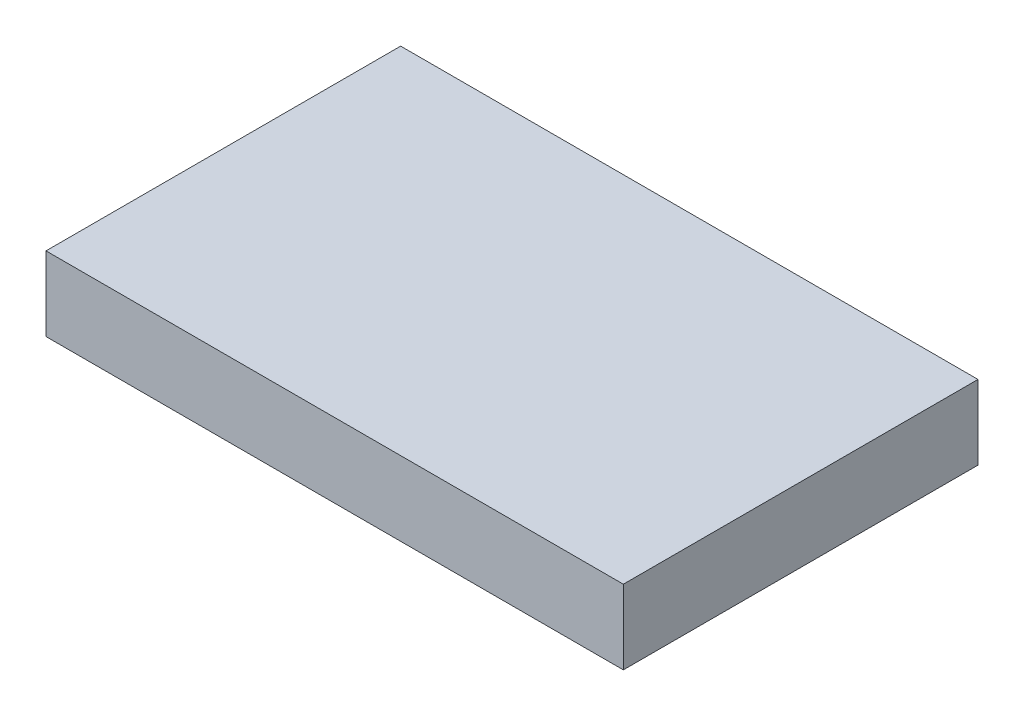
ISO-10303-21;
HEADER;
FILE_DESCRIPTION(('STEP AP214'),'2;1');
FILE_NAME('part.step','',(''),(''),'','','');
FILE_SCHEMA(('AUTOMOTIVE_DESIGN { 1 0 10303 214 1 1 1 1 }'));
ENDSEC;
DATA;
#1=APPLICATION_CONTEXT('core data for automotive mechanical design processes');
#2=APPLICATION_PROTOCOL_DEFINITION('international standard','automotive_design',2000,#1);
#3=PRODUCT_CONTEXT('',#1,'mechanical');
#4=PRODUCT('Part','Part','',(#3));
#5=PRODUCT_RELATED_PRODUCT_CATEGORY('part','',(#4));
#6=PRODUCT_DEFINITION_FORMATION('','',#4);
#7=PRODUCT_DEFINITION_CONTEXT('part definition',#1,'design');
#8=PRODUCT_DEFINITION('design','',#6,#7);
#9=PRODUCT_DEFINITION_SHAPE('','',#8);
#10=(LENGTH_UNIT() NAMED_UNIT(*) SI_UNIT(.MILLI.,.METRE.));
#11=(NAMED_UNIT(*) PLANE_ANGLE_UNIT() SI_UNIT($,.RADIAN.));
#12=(NAMED_UNIT(*) SI_UNIT($,.STERADIAN.) SOLID_ANGLE_UNIT());
#13=UNCERTAINTY_MEASURE_WITH_UNIT(LENGTH_MEASURE(1.E-05),#10,'distance_accuracy_value','');
#14=(GEOMETRIC_REPRESENTATION_CONTEXT(3) GLOBAL_UNCERTAINTY_ASSIGNED_CONTEXT((#13)) GLOBAL_UNIT_ASSIGNED_CONTEXT((#10,
#11,#12)) REPRESENTATION_CONTEXT('',''));
#15=CARTESIAN_POINT('',(0.,0.,0.));
#16=DIRECTION('',(0.,0.,1.));
#17=DIRECTION('',(1.,0.,0.));
#18=AXIS2_PLACEMENT_3D('',#15,#16,#17);
#19=CARTESIAN_POINT('',(82.4132243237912,0.,86.));
#20=DIRECTION('',(0.,1.,0.));
#21=DIRECTION('',(0.,0.,1.));
#22=AXIS2_PLACEMENT_3D('',#19,#20,#21);
#23=PLANE('',#22);
#24=DIRECTION('',(1.,0.,0.));
#25=VECTOR('',#24,1.);
#26=CARTESIAN_POINT('',(82.4132243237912,0.,0.));
#27=LINE('',#26,#25);
#28=CARTESIAN_POINT('',(0.,0.,0.));
#29=VERTEX_POINT('',#28);
#30=CARTESIAN_POINT('',(140.,0.,0.));
#31=VERTEX_POINT('',#30);
#32=EDGE_CURVE('E79',#29,#31,#27,.T.);
#33=ORIENTED_EDGE('',*,*,#32,.T.);
#34=DIRECTION('',(0.,0.,-1.));
#35=VECTOR('',#34,1.);
#36=CARTESIAN_POINT('',(140.,0.,86.));
#37=LINE('',#36,#35);
#38=CARTESIAN_POINT('',(140.,0.,86.));
#39=VERTEX_POINT('',#38);
#40=EDGE_CURVE('E11',#39,#31,#37,.T.);
#41=ORIENTED_EDGE('',*,*,#40,.F.);
#42=DIRECTION('',(1.,0.,0.));
#43=VECTOR('',#42,1.);
#44=CARTESIAN_POINT('',(82.4132243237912,0.,86.));
#45=LINE('',#44,#43);
#46=CARTESIAN_POINT('',(0.,0.,86.));
#47=VERTEX_POINT('',#46);
#48=EDGE_CURVE('E94',#47,#39,#45,.T.);
#49=ORIENTED_EDGE('',*,*,#48,.F.);
#50=DIRECTION('',(0.,0.,-1.));
#51=VECTOR('',#50,1.);
#52=CARTESIAN_POINT('',(0.,0.,86.));
#53=LINE('',#52,#51);
#54=EDGE_CURVE('E46',#47,#29,#53,.T.);
#55=ORIENTED_EDGE('',*,*,#54,.T.);
#56=EDGE_LOOP('',(#33,#41,#49,#55));
#57=FACE_BOUND('',#56,.T.);
#58=ADVANCED_FACE('F32',(#57),#23,.F.);
#59=CARTESIAN_POINT('',(140.,-157.009853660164,86.));
#60=DIRECTION('',(-1.,0.,0.));
#61=DIRECTION('',(0.,0.,1.));
#62=AXIS2_PLACEMENT_3D('',#59,#60,#61);
#63=PLANE('',#62);
#64=DIRECTION('',(0.,1.,0.));
#65=VECTOR('',#64,1.);
#66=CARTESIAN_POINT('',(140.,-157.009853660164,0.));
#67=LINE('',#66,#65);
#68=CARTESIAN_POINT('',(140.,18.,0.));
#69=VERTEX_POINT('',#68);
#70=EDGE_CURVE('E75',#31,#69,#67,.T.);
#71=ORIENTED_EDGE('',*,*,#70,.T.);
#72=DIRECTION('',(0.,0.,-1.));
#73=VECTOR('',#72,1.);
#74=CARTESIAN_POINT('',(140.,18.,86.));
#75=LINE('',#74,#73);
#76=CARTESIAN_POINT('',(140.,18.,86.));
#77=VERTEX_POINT('',#76);
#78=EDGE_CURVE('E39',#77,#69,#75,.T.);
#79=ORIENTED_EDGE('',*,*,#78,.F.);
#80=DIRECTION('',(0.,1.,0.));
#81=VECTOR('',#80,1.);
#82=CARTESIAN_POINT('',(140.,-157.009853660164,86.));
#83=LINE('',#82,#81);
#84=EDGE_CURVE('E86',#39,#77,#83,.T.);
#85=ORIENTED_EDGE('',*,*,#84,.F.);
#86=ORIENTED_EDGE('',*,*,#40,.T.);
#87=EDGE_LOOP('',(#71,#79,#85,#86));
#88=FACE_BOUND('',#87,.T.);
#89=ADVANCED_FACE('F85',(#88),#63,.F.);
#90=CARTESIAN_POINT('',(82.4132243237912,18.,86.));
#91=DIRECTION('',(0.,1.,0.));
#92=DIRECTION('',(0.,0.,1.));
#93=AXIS2_PLACEMENT_3D('',#90,#91,#92);
#94=PLANE('',#93);
#95=DIRECTION('',(1.,0.,0.));
#96=VECTOR('',#95,1.);
#97=CARTESIAN_POINT('',(82.4132243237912,18.,0.));
#98=LINE('',#97,#96);
#99=CARTESIAN_POINT('',(0.,18.,0.));
#100=VERTEX_POINT('',#99);
#101=EDGE_CURVE('E80',#100,#69,#98,.T.);
#102=ORIENTED_EDGE('',*,*,#101,.F.);
#103=DIRECTION('',(0.,0.,-1.));
#104=VECTOR('',#103,1.);
#105=CARTESIAN_POINT('',(0.,18.,86.));
#106=LINE('',#105,#104);
#107=CARTESIAN_POINT('',(0.,18.,86.));
#108=VERTEX_POINT('',#107);
#109=EDGE_CURVE('E54',#108,#100,#106,.T.);
#110=ORIENTED_EDGE('',*,*,#109,.F.);
#111=DIRECTION('',(1.,0.,0.));
#112=VECTOR('',#111,1.);
#113=CARTESIAN_POINT('',(82.4132243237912,18.,86.));
#114=LINE('',#113,#112);
#115=EDGE_CURVE('E97',#108,#77,#114,.T.);
#116=ORIENTED_EDGE('',*,*,#115,.T.);
#117=ORIENTED_EDGE('',*,*,#78,.T.);
#118=EDGE_LOOP('',(#102,#110,#116,#117));
#119=FACE_BOUND('',#118,.T.);
#120=ADVANCED_FACE('F102',(#119),#94,.T.);
#121=CARTESIAN_POINT('',(0.,-157.009853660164,86.));
#122=DIRECTION('',(-1.,0.,0.));
#123=DIRECTION('',(0.,0.,1.));
#124=AXIS2_PLACEMENT_3D('',#121,#122,#123);
#125=PLANE('',#124);
#126=DIRECTION('',(0.,1.,0.));
#127=VECTOR('',#126,1.);
#128=CARTESIAN_POINT('',(0.,-157.009853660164,0.));
#129=LINE('',#128,#127);
#130=EDGE_CURVE('E92',#29,#100,#129,.T.);
#131=ORIENTED_EDGE('',*,*,#130,.F.);
#132=ORIENTED_EDGE('',*,*,#54,.F.);
#133=DIRECTION('',(0.,1.,0.));
#134=VECTOR('',#133,1.);
#135=CARTESIAN_POINT('',(0.,-157.009853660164,86.));
#136=LINE('',#135,#134);
#137=EDGE_CURVE('E99',#47,#108,#136,.T.);
#138=ORIENTED_EDGE('',*,*,#137,.T.);
#139=ORIENTED_EDGE('',*,*,#109,.T.);
#140=EDGE_LOOP('',(#131,#132,#138,#139));
#141=FACE_BOUND('',#140,.T.);
#142=ADVANCED_FACE('F106',(#141),#125,.T.);
#143=CARTESIAN_POINT('',(82.4132243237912,-157.009853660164,86.));
#144=DIRECTION('',(0.,0.,1.));
#145=DIRECTION('',(1.,0.,0.));
#146=AXIS2_PLACEMENT_3D('',#143,#144,#145);
#147=PLANE('',#146);
#148=ORIENTED_EDGE('',*,*,#48,.T.);
#149=ORIENTED_EDGE('',*,*,#84,.T.);
#150=ORIENTED_EDGE('',*,*,#115,.F.);
#151=ORIENTED_EDGE('',*,*,#137,.F.);
#152=EDGE_LOOP('',(#148,#149,#150,#151));
#153=FACE_BOUND('',#152,.T.);
#154=ADVANCED_FACE('F105',(#153),#147,.T.);
#155=CARTESIAN_POINT('',(82.4132243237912,-157.009853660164,0.));
#156=DIRECTION('',(0.,0.,1.));
#157=DIRECTION('',(1.,0.,0.));
#158=AXIS2_PLACEMENT_3D('',#155,#156,#157);
#159=PLANE('',#158);
#160=ORIENTED_EDGE('',*,*,#32,.F.);
#161=ORIENTED_EDGE('',*,*,#130,.T.);
#162=ORIENTED_EDGE('',*,*,#101,.T.);
#163=ORIENTED_EDGE('',*,*,#70,.F.);
#164=EDGE_LOOP('',(#160,#161,#162,#163));
#165=FACE_BOUND('',#164,.T.);
#166=ADVANCED_FACE('F76',(#165),#159,.F.);
#167=CLOSED_SHELL('',(#58,#89,#120,#142,#154,#166));
#168=MANIFOLD_SOLID_BREP('B2',#167);
#169=ADVANCED_BREP_SHAPE_REPRESENTATION('',(#18,#168),#14);
#170=SHAPE_DEFINITION_REPRESENTATION(#9,#169);
ENDSEC;
END-ISO-10303-21;
